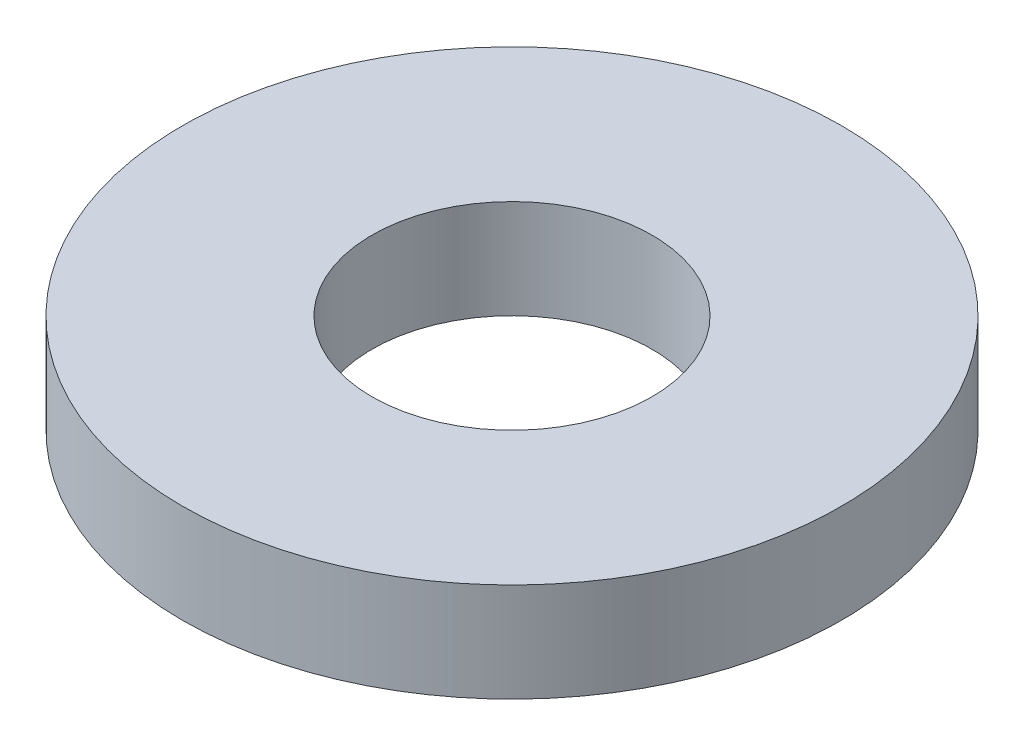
from build123d import *

# Parameters (mm, degrees)
ESQUISSE1_R          = 20
ESQUISSE1_R_2        = 8.5
BASE_EXTRUSION_DEPTH = 6


with BuildPart() as part:
    # Esquisse1 → Base-Extrusion (new body)
    with BuildSketch(Plane(origin=(0, 0, 0), x_dir=(1, 0, 0), z_dir=(0, 1, 0))):
        with Locations(Location((0, 0, 0), (0, 0, 270))):
            Circle(ESQUISSE1_R)
        with Locations(Location((0, 0, 0), (0, 0, 270))):
            Circle(ESQUISSE1_R_2, mode=Mode.SUBTRACT)
    extrude(amount=BASE_EXTRUSION_DEPTH)


solid = part.part
